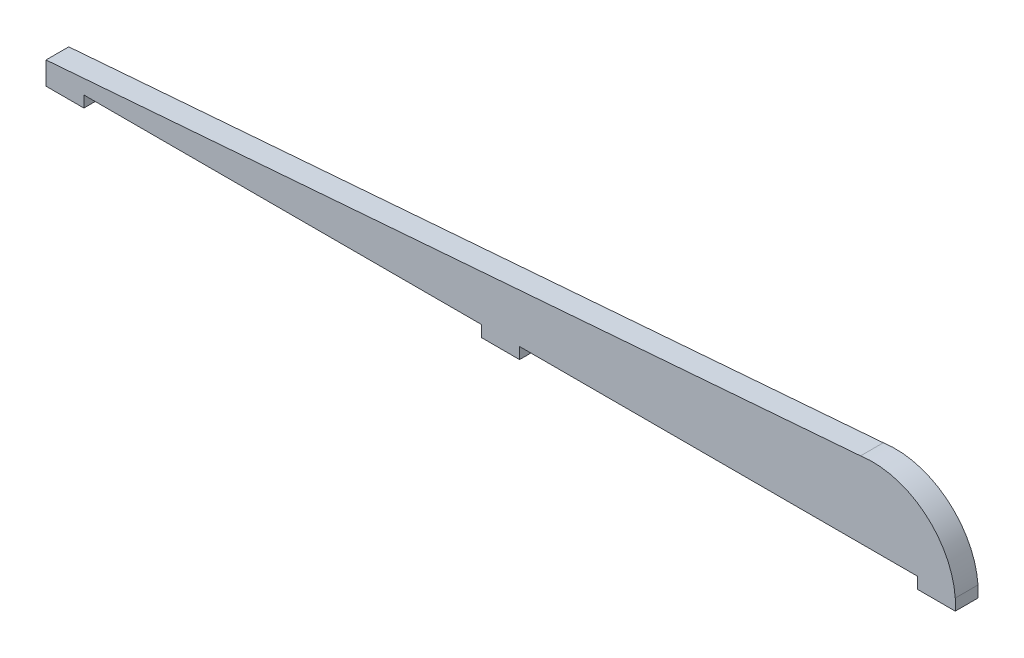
ISO-10303-21;
HEADER;
FILE_DESCRIPTION(('STEP AP214'),'2;1');
FILE_NAME('part.step','',(''),(''),'','','');
FILE_SCHEMA(('AUTOMOTIVE_DESIGN { 1 0 10303 214 1 1 1 1 }'));
ENDSEC;
DATA;
#1=APPLICATION_CONTEXT('core data for automotive mechanical design processes');
#2=APPLICATION_PROTOCOL_DEFINITION('international standard','automotive_design',2000,#1);
#3=PRODUCT_CONTEXT('',#1,'mechanical');
#4=PRODUCT('Part','Part','',(#3));
#5=PRODUCT_RELATED_PRODUCT_CATEGORY('part','',(#4));
#6=PRODUCT_DEFINITION_FORMATION('','',#4);
#7=PRODUCT_DEFINITION_CONTEXT('part definition',#1,'design');
#8=PRODUCT_DEFINITION('design','',#6,#7);
#9=PRODUCT_DEFINITION_SHAPE('','',#8);
#10=(LENGTH_UNIT() NAMED_UNIT(*) SI_UNIT(.MILLI.,.METRE.));
#11=(NAMED_UNIT(*) PLANE_ANGLE_UNIT() SI_UNIT($,.RADIAN.));
#12=(NAMED_UNIT(*) SI_UNIT($,.STERADIAN.) SOLID_ANGLE_UNIT());
#13=UNCERTAINTY_MEASURE_WITH_UNIT(LENGTH_MEASURE(1.E-05),#10,'distance_accuracy_value','');
#14=(GEOMETRIC_REPRESENTATION_CONTEXT(3) GLOBAL_UNCERTAINTY_ASSIGNED_CONTEXT((#13)) GLOBAL_UNIT_ASSIGNED_CONTEXT((#10,
#11,#12)) REPRESENTATION_CONTEXT('',''));
#15=CARTESIAN_POINT('',(0.,0.,0.));
#16=DIRECTION('',(0.,0.,1.));
#17=DIRECTION('',(1.,0.,0.));
#18=AXIS2_PLACEMENT_3D('',#15,#16,#17);
#19=CARTESIAN_POINT('',(-119.999999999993,0.,6.));
#20=DIRECTION('',(1.,0.,0.));
#21=DIRECTION('',(0.,0.,-1.));
#22=AXIS2_PLACEMENT_3D('',#19,#20,#21);
#23=PLANE('',#22);
#24=DIRECTION('',(0.,-1.,0.));
#25=VECTOR('',#24,1.);
#26=CARTESIAN_POINT('',(-119.999999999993,0.,0.));
#27=LINE('',#26,#25);
#28=CARTESIAN_POINT('',(-119.999999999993,3.,0.));
#29=VERTEX_POINT('',#28);
#30=CARTESIAN_POINT('',(-119.999999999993,-3.,0.));
#31=VERTEX_POINT('',#30);
#32=EDGE_CURVE('E100',#29,#31,#27,.T.);
#33=ORIENTED_EDGE('',*,*,#32,.T.);
#34=DIRECTION('',(0.,0.,-1.));
#35=VECTOR('',#34,1.);
#36=CARTESIAN_POINT('',(-119.999999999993,-3.,6.));
#37=LINE('',#36,#35);
#38=CARTESIAN_POINT('',(-119.999999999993,-3.,6.));
#39=VERTEX_POINT('',#38);
#40=EDGE_CURVE('E11',#39,#31,#37,.T.);
#41=ORIENTED_EDGE('',*,*,#40,.F.);
#42=DIRECTION('',(0.,1.,0.));
#43=VECTOR('',#42,1.);
#44=CARTESIAN_POINT('',(-119.999999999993,0.,6.));
#45=LINE('',#44,#43);
#46=CARTESIAN_POINT('',(-119.999999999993,3.,6.));
#47=VERTEX_POINT('',#46);
#48=EDGE_CURVE('E51',#39,#47,#45,.T.);
#49=ORIENTED_EDGE('',*,*,#48,.T.);
#50=DIRECTION('',(0.,0.,-1.));
#51=VECTOR('',#50,1.);
#52=CARTESIAN_POINT('',(-119.999999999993,3.,6.));
#53=LINE('',#52,#51);
#54=EDGE_CURVE('E36',#47,#29,#53,.T.);
#55=ORIENTED_EDGE('',*,*,#54,.T.);
#56=EDGE_LOOP('',(#33,#41,#49,#55));
#57=FACE_BOUND('',#56,.T.);
#58=ADVANCED_FACE('F32',(#57),#23,.F.);
#59=CARTESIAN_POINT('',(-119.999999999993,-3.,6.));
#60=DIRECTION('',(0.,1.,0.));
#61=DIRECTION('',(0.,0.,1.));
#62=AXIS2_PLACEMENT_3D('',#59,#60,#61);
#63=PLANE('',#62);
#64=DIRECTION('',(1.,0.,0.));
#65=VECTOR('',#64,1.);
#66=CARTESIAN_POINT('',(-119.999999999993,-3.,0.));
#67=LINE('',#66,#65);
#68=CARTESIAN_POINT('',(-109.999999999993,-3.,0.));
#69=VERTEX_POINT('',#68);
#70=EDGE_CURVE('E187',#31,#69,#67,.T.);
#71=ORIENTED_EDGE('',*,*,#70,.T.);
#72=DIRECTION('',(0.,0.,-1.));
#73=VECTOR('',#72,1.);
#74=CARTESIAN_POINT('',(-109.999999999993,-3.,6.));
#75=LINE('',#74,#73);
#76=CARTESIAN_POINT('',(-109.999999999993,-3.,6.));
#77=VERTEX_POINT('',#76);
#78=EDGE_CURVE('E42',#77,#69,#75,.T.);
#79=ORIENTED_EDGE('',*,*,#78,.F.);
#80=DIRECTION('',(1.,0.,0.));
#81=VECTOR('',#80,1.);
#82=CARTESIAN_POINT('',(-119.999999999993,-3.,6.));
#83=LINE('',#82,#81);
#84=EDGE_CURVE('E154',#39,#77,#83,.T.);
#85=ORIENTED_EDGE('',*,*,#84,.F.);
#86=ORIENTED_EDGE('',*,*,#40,.T.);
#87=EDGE_LOOP('',(#71,#79,#85,#86));
#88=FACE_BOUND('',#87,.T.);
#89=ADVANCED_FACE('F215',(#88),#63,.F.);
#90=CARTESIAN_POINT('',(-109.999999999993,0.,6.));
#91=DIRECTION('',(1.,0.,0.));
#92=DIRECTION('',(0.,1.,0.));
#93=AXIS2_PLACEMENT_3D('',#90,#91,#92);
#94=PLANE('',#93);
#95=DIRECTION('',(0.,-1.,0.));
#96=VECTOR('',#95,1.);
#97=CARTESIAN_POINT('',(-109.999999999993,0.,0.));
#98=LINE('',#97,#96);
#99=CARTESIAN_POINT('',(-109.999999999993,0.,0.));
#100=VERTEX_POINT('',#99);
#101=EDGE_CURVE('E140',#100,#69,#98,.T.);
#102=ORIENTED_EDGE('',*,*,#101,.F.);
#103=DIRECTION('',(0.,0.,-1.));
#104=VECTOR('',#103,1.);
#105=CARTESIAN_POINT('',(-109.999999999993,0.,6.));
#106=LINE('',#105,#104);
#107=CARTESIAN_POINT('',(-109.999999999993,0.,6.));
#108=VERTEX_POINT('',#107);
#109=EDGE_CURVE('E134',#108,#100,#106,.T.);
#110=ORIENTED_EDGE('',*,*,#109,.F.);
#111=DIRECTION('',(0.,-1.,0.));
#112=VECTOR('',#111,1.);
#113=CARTESIAN_POINT('',(-109.999999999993,0.,6.));
#114=LINE('',#113,#112);
#115=EDGE_CURVE('E138',#108,#77,#114,.T.);
#116=ORIENTED_EDGE('',*,*,#115,.T.);
#117=ORIENTED_EDGE('',*,*,#78,.T.);
#118=EDGE_LOOP('',(#102,#110,#116,#117));
#119=FACE_BOUND('',#118,.T.);
#120=ADVANCED_FACE('F136',(#119),#94,.T.);
#121=CARTESIAN_POINT('',(-109.999999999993,0.,6.));
#122=DIRECTION('',(0.,1.,0.));
#123=DIRECTION('',(0.,0.,1.));
#124=AXIS2_PLACEMENT_3D('',#121,#122,#123);
#125=PLANE('',#124);
#126=DIRECTION('',(1.,0.,0.));
#127=VECTOR('',#126,1.);
#128=CARTESIAN_POINT('',(-109.999999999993,0.,0.));
#129=LINE('',#128,#127);
#130=CARTESIAN_POINT('',(-4.99999999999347,0.,0.));
#131=VERTEX_POINT('',#130);
#132=EDGE_CURVE('E184',#100,#131,#129,.T.);
#133=ORIENTED_EDGE('',*,*,#132,.T.);
#134=DIRECTION('',(0.,0.,-1.));
#135=VECTOR('',#134,1.);
#136=CARTESIAN_POINT('',(-4.99999999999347,0.,6.));
#137=LINE('',#136,#135);
#138=CARTESIAN_POINT('',(-4.99999999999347,0.,6.));
#139=VERTEX_POINT('',#138);
#140=EDGE_CURVE('E143',#139,#131,#137,.T.);
#141=ORIENTED_EDGE('',*,*,#140,.F.);
#142=DIRECTION('',(1.,0.,0.));
#143=VECTOR('',#142,1.);
#144=CARTESIAN_POINT('',(-109.999999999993,0.,6.));
#145=LINE('',#144,#143);
#146=EDGE_CURVE('E146',#108,#139,#145,.T.);
#147=ORIENTED_EDGE('',*,*,#146,.F.);
#148=ORIENTED_EDGE('',*,*,#109,.T.);
#149=EDGE_LOOP('',(#133,#141,#147,#148));
#150=FACE_BOUND('',#149,.T.);
#151=ADVANCED_FACE('F147',(#150),#125,.F.);
#152=CARTESIAN_POINT('',(-4.99999999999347,0.,6.));
#153=DIRECTION('',(1.,0.,0.));
#154=DIRECTION('',(0.,1.,0.));
#155=AXIS2_PLACEMENT_3D('',#152,#153,#154);
#156=PLANE('',#155);
#157=DIRECTION('',(0.,-1.,0.));
#158=VECTOR('',#157,1.);
#159=CARTESIAN_POINT('',(-4.99999999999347,0.,0.));
#160=LINE('',#159,#158);
#161=CARTESIAN_POINT('',(-4.99999999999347,-2.99999999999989,0.));
#162=VERTEX_POINT('',#161);
#163=EDGE_CURVE('E182',#131,#162,#160,.T.);
#164=ORIENTED_EDGE('',*,*,#163,.T.);
#165=DIRECTION('',(0.,0.,-1.));
#166=VECTOR('',#165,1.);
#167=CARTESIAN_POINT('',(-4.99999999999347,-2.99999999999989,6.));
#168=LINE('',#167,#166);
#169=CARTESIAN_POINT('',(-4.99999999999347,-2.99999999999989,6.));
#170=VERTEX_POINT('',#169);
#171=EDGE_CURVE('E192',#170,#162,#168,.T.);
#172=ORIENTED_EDGE('',*,*,#171,.F.);
#173=DIRECTION('',(0.,-1.,0.));
#174=VECTOR('',#173,1.);
#175=CARTESIAN_POINT('',(-4.99999999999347,0.,6.));
#176=LINE('',#175,#174);
#177=EDGE_CURVE('E150',#139,#170,#176,.T.);
#178=ORIENTED_EDGE('',*,*,#177,.F.);
#179=ORIENTED_EDGE('',*,*,#140,.T.);
#180=EDGE_LOOP('',(#164,#172,#178,#179));
#181=FACE_BOUND('',#180,.T.);
#182=ADVANCED_FACE('F228',(#181),#156,.F.);
#183=CARTESIAN_POINT('',(-4.99999999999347,-2.99999999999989,6.));
#184=DIRECTION('',(0.,1.,0.));
#185=DIRECTION('',(0.,0.,1.));
#186=AXIS2_PLACEMENT_3D('',#183,#184,#185);
#187=PLANE('',#186);
#188=DIRECTION('',(1.,0.,0.));
#189=VECTOR('',#188,1.);
#190=CARTESIAN_POINT('',(-4.99999999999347,-2.99999999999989,0.));
#191=LINE('',#190,#189);
#192=CARTESIAN_POINT('',(5.00000000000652,-2.99999999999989,0.));
#193=VERTEX_POINT('',#192);
#194=EDGE_CURVE('E179',#162,#193,#191,.T.);
#195=ORIENTED_EDGE('',*,*,#194,.T.);
#196=DIRECTION('',(0.,0.,-1.));
#197=VECTOR('',#196,1.);
#198=CARTESIAN_POINT('',(5.00000000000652,-2.99999999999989,6.));
#199=LINE('',#198,#197);
#200=CARTESIAN_POINT('',(5.00000000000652,-2.99999999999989,6.));
#201=VERTEX_POINT('',#200);
#202=EDGE_CURVE('E195',#201,#193,#199,.T.);
#203=ORIENTED_EDGE('',*,*,#202,.F.);
#204=DIRECTION('',(1.,0.,0.));
#205=VECTOR('',#204,1.);
#206=CARTESIAN_POINT('',(-4.99999999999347,-2.99999999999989,6.));
#207=LINE('',#206,#205);
#208=EDGE_CURVE('E287',#170,#201,#207,.T.);
#209=ORIENTED_EDGE('',*,*,#208,.F.);
#210=ORIENTED_EDGE('',*,*,#171,.T.);
#211=EDGE_LOOP('',(#195,#203,#209,#210));
#212=FACE_BOUND('',#211,.T.);
#213=ADVANCED_FACE('F231',(#212),#187,.F.);
#214=CARTESIAN_POINT('',(5.00000000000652,0.,6.));
#215=DIRECTION('',(1.,0.,0.));
#216=DIRECTION('',(0.,1.,0.));
#217=AXIS2_PLACEMENT_3D('',#214,#215,#216);
#218=PLANE('',#217);
#219=DIRECTION('',(0.,-1.,0.));
#220=VECTOR('',#219,1.);
#221=CARTESIAN_POINT('',(5.00000000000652,0.,0.));
#222=LINE('',#221,#220);
#223=CARTESIAN_POINT('',(5.00000000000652,0.,0.));
#224=VERTEX_POINT('',#223);
#225=EDGE_CURVE('E176',#224,#193,#222,.T.);
#226=ORIENTED_EDGE('',*,*,#225,.F.);
#227=DIRECTION('',(0.,0.,-1.));
#228=VECTOR('',#227,1.);
#229=CARTESIAN_POINT('',(5.00000000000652,0.,6.));
#230=LINE('',#229,#228);
#231=CARTESIAN_POINT('',(5.00000000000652,0.,6.));
#232=VERTEX_POINT('',#231);
#233=EDGE_CURVE('E197',#232,#224,#230,.T.);
#234=ORIENTED_EDGE('',*,*,#233,.F.);
#235=DIRECTION('',(0.,-1.,0.));
#236=VECTOR('',#235,1.);
#237=CARTESIAN_POINT('',(5.00000000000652,0.,6.));
#238=LINE('',#237,#236);
#239=EDGE_CURVE('E283',#232,#201,#238,.T.);
#240=ORIENTED_EDGE('',*,*,#239,.T.);
#241=ORIENTED_EDGE('',*,*,#202,.T.);
#242=EDGE_LOOP('',(#226,#234,#240,#241));
#243=FACE_BOUND('',#242,.T.);
#244=ADVANCED_FACE('F235',(#243),#218,.T.);
#245=CARTESIAN_POINT('',(5.00000000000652,0.,6.));
#246=DIRECTION('',(0.,1.,0.));
#247=DIRECTION('',(-1.,0.,0.));
#248=AXIS2_PLACEMENT_3D('',#245,#246,#247);
#249=PLANE('',#248);
#250=DIRECTION('',(1.,0.,0.));
#251=VECTOR('',#250,1.);
#252=CARTESIAN_POINT('',(5.00000000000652,0.,0.));
#253=LINE('',#252,#251);
#254=CARTESIAN_POINT('',(109.999999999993,8.88178419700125E-13,0.));
#255=VERTEX_POINT('',#254);
#256=EDGE_CURVE('E174',#224,#255,#253,.T.);
#257=ORIENTED_EDGE('',*,*,#256,.T.);
#258=DIRECTION('',(0.,0.,-1.));
#259=VECTOR('',#258,1.);
#260=CARTESIAN_POINT('',(109.999999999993,8.88178419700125E-13,6.));
#261=LINE('',#260,#259);
#262=CARTESIAN_POINT('',(109.999999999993,8.88178419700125E-13,6.));
#263=VERTEX_POINT('',#262);
#264=EDGE_CURVE('E199',#263,#255,#261,.T.);
#265=ORIENTED_EDGE('',*,*,#264,.F.);
#266=DIRECTION('',(1.,0.,0.));
#267=VECTOR('',#266,1.);
#268=CARTESIAN_POINT('',(5.00000000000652,0.,6.));
#269=LINE('',#268,#267);
#270=EDGE_CURVE('E277',#232,#263,#269,.T.);
#271=ORIENTED_EDGE('',*,*,#270,.F.);
#272=ORIENTED_EDGE('',*,*,#233,.T.);
#273=EDGE_LOOP('',(#257,#265,#271,#272));
#274=FACE_BOUND('',#273,.T.);
#275=ADVANCED_FACE('F239',(#274),#249,.F.);
#276=CARTESIAN_POINT('',(109.999999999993,8.88178419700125E-13,6.));
#277=DIRECTION('',(1.,0.,0.));
#278=DIRECTION('',(0.,1.,0.));
#279=AXIS2_PLACEMENT_3D('',#276,#277,#278);
#280=PLANE('',#279);
#281=DIRECTION('',(0.,-1.,0.));
#282=VECTOR('',#281,1.);
#283=CARTESIAN_POINT('',(109.999999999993,8.88178419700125E-13,0.));
#284=LINE('',#283,#282);
#285=CARTESIAN_POINT('',(109.999999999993,-2.99999999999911,0.));
#286=VERTEX_POINT('',#285);
#287=EDGE_CURVE('E171',#255,#286,#284,.T.);
#288=ORIENTED_EDGE('',*,*,#287,.T.);
#289=DIRECTION('',(0.,0.,-1.));
#290=VECTOR('',#289,1.);
#291=CARTESIAN_POINT('',(109.999999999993,-2.99999999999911,6.));
#292=LINE('',#291,#290);
#293=CARTESIAN_POINT('',(109.999999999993,-2.99999999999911,6.));
#294=VERTEX_POINT('',#293);
#295=EDGE_CURVE('E202',#294,#286,#292,.T.);
#296=ORIENTED_EDGE('',*,*,#295,.F.);
#297=DIRECTION('',(0.,-1.,0.));
#298=VECTOR('',#297,1.);
#299=CARTESIAN_POINT('',(109.999999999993,8.88178419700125E-13,6.));
#300=LINE('',#299,#298);
#301=EDGE_CURVE('E275',#263,#294,#300,.T.);
#302=ORIENTED_EDGE('',*,*,#301,.F.);
#303=ORIENTED_EDGE('',*,*,#264,.T.);
#304=EDGE_LOOP('',(#288,#296,#302,#303));
#305=FACE_BOUND('',#304,.T.);
#306=ADVANCED_FACE('F243',(#305),#280,.F.);
#307=CARTESIAN_POINT('',(119.999999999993,-2.99999999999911,6.));
#308=DIRECTION('',(0.,-1.,0.));
#309=DIRECTION('',(0.,0.,-1.));
#310=AXIS2_PLACEMENT_3D('',#307,#308,#309);
#311=PLANE('',#310);
#312=DIRECTION('',(-1.,0.,0.));
#313=VECTOR('',#312,1.);
#314=CARTESIAN_POINT('',(119.999999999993,-2.99999999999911,0.));
#315=LINE('',#314,#313);
#316=CARTESIAN_POINT('',(119.999999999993,-2.99999999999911,0.));
#317=VERTEX_POINT('',#316);
#318=EDGE_CURVE('E168',#317,#286,#315,.T.);
#319=ORIENTED_EDGE('',*,*,#318,.F.);
#320=DIRECTION('',(0.,0.,-1.));
#321=VECTOR('',#320,1.);
#322=CARTESIAN_POINT('',(119.999999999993,-2.99999999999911,6.));
#323=LINE('',#322,#321);
#324=CARTESIAN_POINT('',(119.999999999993,-2.99999999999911,6.));
#325=VERTEX_POINT('',#324);
#326=EDGE_CURVE('E204',#325,#317,#323,.T.);
#327=ORIENTED_EDGE('',*,*,#326,.F.);
#328=DIRECTION('',(-1.,0.,0.));
#329=VECTOR('',#328,1.);
#330=CARTESIAN_POINT('',(119.999999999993,-2.99999999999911,6.));
#331=LINE('',#330,#329);
#332=EDGE_CURVE('E272',#325,#294,#331,.T.);
#333=ORIENTED_EDGE('',*,*,#332,.T.);
#334=ORIENTED_EDGE('',*,*,#295,.T.);
#335=EDGE_LOOP('',(#319,#327,#333,#334));
#336=FACE_BOUND('',#335,.T.);
#337=ADVANCED_FACE('F247',(#336),#311,.T.);
#338=CARTESIAN_POINT('',(120.000000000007,0.,6.));
#339=DIRECTION('',(1.,-4.34837351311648E-12,0.));
#340=DIRECTION('',(4.34837351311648E-12,1.,0.));
#341=AXIS2_PLACEMENT_3D('',#338,#339,#340);
#342=PLANE('',#341);
#343=DIRECTION('',(-4.34837351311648E-12,-1.,0.));
#344=VECTOR('',#343,1.);
#345=CARTESIAN_POINT('',(120.000000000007,0.,0.));
#346=LINE('',#345,#344);
#347=CARTESIAN_POINT('',(120.000000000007,0.,0.));
#348=VERTEX_POINT('',#347);
#349=EDGE_CURVE('E165',#348,#317,#346,.T.);
#350=ORIENTED_EDGE('',*,*,#349,.F.);
#351=DIRECTION('',(0.,0.,-1.));
#352=VECTOR('',#351,1.);
#353=CARTESIAN_POINT('',(120.000000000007,0.,6.));
#354=LINE('',#353,#352);
#355=CARTESIAN_POINT('',(120.000000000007,0.,6.));
#356=VERTEX_POINT('',#355);
#357=EDGE_CURVE('E206',#356,#348,#354,.T.);
#358=ORIENTED_EDGE('',*,*,#357,.F.);
#359=DIRECTION('',(-4.34837351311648E-12,-1.,0.));
#360=VECTOR('',#359,1.);
#361=CARTESIAN_POINT('',(120.000000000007,0.,6.));
#362=LINE('',#361,#360);
#363=EDGE_CURVE('E265',#356,#325,#362,.T.);
#364=ORIENTED_EDGE('',*,*,#363,.T.);
#365=ORIENTED_EDGE('',*,*,#326,.T.);
#366=EDGE_LOOP('',(#350,#358,#364,#365));
#367=FACE_BOUND('',#366,.T.);
#368=ADVANCED_FACE('F251',(#367),#342,.T.);
#369=CARTESIAN_POINT('',(98.1838454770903,-1.64519315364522,6.));
#370=DIRECTION('',(0.,0.,-1.));
#371=DIRECTION('',(-1.,0.,0.));
#372=AXIS2_PLACEMENT_3D('',#369,#370,#371);
#373=CYLINDRICAL_SURFACE('',#372,21.8780999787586);
#374=CARTESIAN_POINT('',(98.1838454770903,-1.64519315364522,0.));
#375=DIRECTION('',(0.,0.,1.));
#376=DIRECTION('',(1.,0.,0.));
#377=AXIS2_PLACEMENT_3D('',#374,#375,#376);
#378=CIRCLE('',#377,21.8780999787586);
#379=CARTESIAN_POINT('',(95.0000000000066,20.,0.));
#380=VERTEX_POINT('',#379);
#381=EDGE_CURVE('E162',#348,#380,#378,.T.);
#382=ORIENTED_EDGE('',*,*,#381,.T.);
#383=DIRECTION('',(0.,0.,-1.));
#384=VECTOR('',#383,1.);
#385=CARTESIAN_POINT('',(95.0000000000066,20.,6.));
#386=LINE('',#385,#384);
#387=CARTESIAN_POINT('',(95.0000000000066,20.,6.));
#388=VERTEX_POINT('',#387);
#389=EDGE_CURVE('E207',#388,#380,#386,.T.);
#390=ORIENTED_EDGE('',*,*,#389,.F.);
#391=CARTESIAN_POINT('',(98.1838454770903,-1.64519315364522,6.));
#392=DIRECTION('',(0.,0.,1.));
#393=DIRECTION('',(1.,0.,0.));
#394=AXIS2_PLACEMENT_3D('',#391,#392,#393);
#395=CIRCLE('',#394,21.8780999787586);
#396=EDGE_CURVE('E262',#356,#388,#395,.T.);
#397=ORIENTED_EDGE('',*,*,#396,.F.);
#398=ORIENTED_EDGE('',*,*,#357,.T.);
#399=EDGE_LOOP('',(#382,#390,#397,#398));
#400=FACE_BOUND('',#399,.T.);
#401=ADVANCED_FACE('F254',(#400),#373,.T.);
#402=CARTESIAN_POINT('',(-119.999999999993,3.,6.));
#403=DIRECTION('',(-0.078823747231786,0.996888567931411,0.));
#404=DIRECTION('',(-0.996888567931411,-0.078823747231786,0.));
#405=AXIS2_PLACEMENT_3D('',#402,#403,#404);
#406=PLANE('',#405);
#407=DIRECTION('',(0.996888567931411,0.078823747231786,0.));
#408=VECTOR('',#407,1.);
#409=CARTESIAN_POINT('',(-119.999999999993,3.,0.));
#410=LINE('',#409,#408);
#411=EDGE_CURVE('E159',#29,#380,#410,.T.);
#412=ORIENTED_EDGE('',*,*,#411,.F.);
#413=ORIENTED_EDGE('',*,*,#54,.F.);
#414=DIRECTION('',(0.996888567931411,0.078823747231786,0.));
#415=VECTOR('',#414,1.);
#416=CARTESIAN_POINT('',(-119.999999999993,3.,6.));
#417=LINE('',#416,#415);
#418=EDGE_CURVE('E296',#47,#388,#417,.T.);
#419=ORIENTED_EDGE('',*,*,#418,.T.);
#420=ORIENTED_EDGE('',*,*,#389,.T.);
#421=EDGE_LOOP('',(#412,#413,#419,#420));
#422=FACE_BOUND('',#421,.T.);
#423=ADVANCED_FACE('F34',(#422),#406,.T.);
#424=CARTESIAN_POINT('',(98.1838454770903,-1.64519315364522,6.));
#425=DIRECTION('',(0.,0.,1.));
#426=DIRECTION('',(1.,0.,0.));
#427=AXIS2_PLACEMENT_3D('',#424,#425,#426);
#428=PLANE('',#427);
#429=ORIENTED_EDGE('',*,*,#48,.F.);
#430=ORIENTED_EDGE('',*,*,#84,.T.);
#431=ORIENTED_EDGE('',*,*,#115,.F.);
#432=ORIENTED_EDGE('',*,*,#146,.T.);
#433=ORIENTED_EDGE('',*,*,#177,.T.);
#434=ORIENTED_EDGE('',*,*,#208,.T.);
#435=ORIENTED_EDGE('',*,*,#239,.F.);
#436=ORIENTED_EDGE('',*,*,#270,.T.);
#437=ORIENTED_EDGE('',*,*,#301,.T.);
#438=ORIENTED_EDGE('',*,*,#332,.F.);
#439=ORIENTED_EDGE('',*,*,#363,.F.);
#440=ORIENTED_EDGE('',*,*,#396,.T.);
#441=ORIENTED_EDGE('',*,*,#418,.F.);
#442=EDGE_LOOP('',(#429,#430,#431,#432,#433,#434,#435,#436,#437,#438,#439,#440,#441));
#443=FACE_BOUND('',#442,.T.);
#444=ADVANCED_FACE('F152',(#443),#428,.T.);
#445=CARTESIAN_POINT('',(98.1838454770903,-1.64519315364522,0.));
#446=DIRECTION('',(0.,0.,1.));
#447=DIRECTION('',(1.,0.,0.));
#448=AXIS2_PLACEMENT_3D('',#445,#446,#447);
#449=PLANE('',#448);
#450=ORIENTED_EDGE('',*,*,#32,.F.);
#451=ORIENTED_EDGE('',*,*,#411,.T.);
#452=ORIENTED_EDGE('',*,*,#381,.F.);
#453=ORIENTED_EDGE('',*,*,#349,.T.);
#454=ORIENTED_EDGE('',*,*,#318,.T.);
#455=ORIENTED_EDGE('',*,*,#287,.F.);
#456=ORIENTED_EDGE('',*,*,#256,.F.);
#457=ORIENTED_EDGE('',*,*,#225,.T.);
#458=ORIENTED_EDGE('',*,*,#194,.F.);
#459=ORIENTED_EDGE('',*,*,#163,.F.);
#460=ORIENTED_EDGE('',*,*,#132,.F.);
#461=ORIENTED_EDGE('',*,*,#101,.T.);
#462=ORIENTED_EDGE('',*,*,#70,.F.);
#463=EDGE_LOOP('',(#450,#451,#452,#453,#454,#455,#456,#457,#458,#459,#460,#461,#462));
#464=FACE_BOUND('',#463,.T.);
#465=ADVANCED_FACE('F211',(#464),#449,.F.);
#466=CLOSED_SHELL('',(#58,#89,#120,#151,#182,#213,#244,#275,#306,#337,#368,#401,#423,#444,#465));
#467=MANIFOLD_SOLID_BREP('B2',#466);
#468=ADVANCED_BREP_SHAPE_REPRESENTATION('',(#18,#467),#14);
#469=SHAPE_DEFINITION_REPRESENTATION(#9,#468);
ENDSEC;
END-ISO-10303-21;
